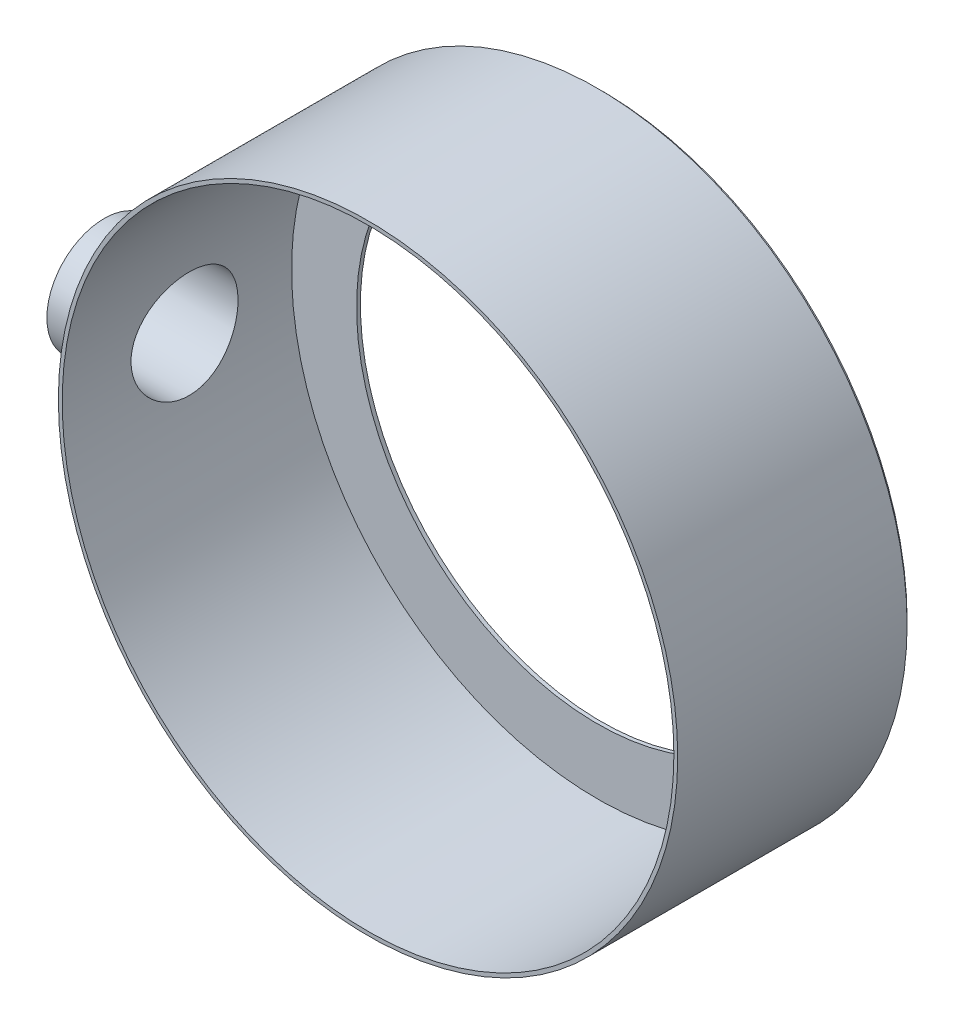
ISO-10303-21;
HEADER;
FILE_DESCRIPTION(('STEP AP214'),'2;1');
FILE_NAME('part.step','',(''),(''),'','','');
FILE_SCHEMA(('AUTOMOTIVE_DESIGN { 1 0 10303 214 1 1 1 1 }'));
ENDSEC;
DATA;
#1=APPLICATION_CONTEXT('core data for automotive mechanical design processes');
#2=APPLICATION_PROTOCOL_DEFINITION('international standard','automotive_design',2000,#1);
#3=PRODUCT_CONTEXT('',#1,'mechanical');
#4=PRODUCT('Part','Part','',(#3));
#5=PRODUCT_RELATED_PRODUCT_CATEGORY('part','',(#4));
#6=PRODUCT_DEFINITION_FORMATION('','',#4);
#7=PRODUCT_DEFINITION_CONTEXT('part definition',#1,'design');
#8=PRODUCT_DEFINITION('design','',#6,#7);
#9=PRODUCT_DEFINITION_SHAPE('','',#8);
#10=(LENGTH_UNIT() NAMED_UNIT(*) SI_UNIT(.MILLI.,.METRE.));
#11=(NAMED_UNIT(*) PLANE_ANGLE_UNIT() SI_UNIT($,.RADIAN.));
#12=(NAMED_UNIT(*) SI_UNIT($,.STERADIAN.) SOLID_ANGLE_UNIT());
#13=UNCERTAINTY_MEASURE_WITH_UNIT(LENGTH_MEASURE(1.E-05),#10,'distance_accuracy_value','');
#14=(GEOMETRIC_REPRESENTATION_CONTEXT(3) GLOBAL_UNCERTAINTY_ASSIGNED_CONTEXT((#13)) GLOBAL_UNIT_ASSIGNED_CONTEXT((#10,
#11,#12)) REPRESENTATION_CONTEXT('',''));
#15=CARTESIAN_POINT('',(0.,0.,0.));
#16=DIRECTION('',(0.,0.,1.));
#17=DIRECTION('',(1.,0.,0.));
#18=AXIS2_PLACEMENT_3D('',#15,#16,#17);
#19=CARTESIAN_POINT('',(0.,0.,30.5));
#20=DIRECTION('',(0.,0.,-1.));
#21=DIRECTION('',(-1.,0.,0.));
#22=AXIS2_PLACEMENT_3D('',#19,#20,#21);
#23=CYLINDRICAL_SURFACE('',#22,40.5);
#24=CARTESIAN_POINT('',(0.,0.,0.5));
#25=DIRECTION('',(0.,0.,1.));
#26=DIRECTION('',(1.,0.,0.));
#27=AXIS2_PLACEMENT_3D('',#24,#25,#26);
#28=CIRCLE('',#27,40.5);
#29=CARTESIAN_POINT('',(40.5,0.,0.5));
#30=VERTEX_POINT('',#29);
#31=EDGE_CURVE('E58',#30,#30,#28,.T.);
#32=ORIENTED_EDGE('',*,*,#31,.T.);
#33=EDGE_LOOP('',(#32));
#34=FACE_BOUND('',#33,.T.);
#35=CARTESIAN_POINT('',(0.,0.,30.5));
#36=DIRECTION('',(0.,0.,1.));
#37=DIRECTION('',(1.,0.,0.));
#38=AXIS2_PLACEMENT_3D('',#35,#36,#37);
#39=CIRCLE('',#38,40.5);
#40=CARTESIAN_POINT('',(40.5,0.,30.5));
#41=VERTEX_POINT('',#40);
#42=EDGE_CURVE('E54',#41,#41,#39,.T.);
#43=ORIENTED_EDGE('',*,*,#42,.F.);
#44=EDGE_LOOP('',(#43));
#45=FACE_BOUND('',#44,.T.);
#46=CARTESIAN_POINT('',(-40.5,0.,22.));
#47=CARTESIAN_POINT('',(-40.5000017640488,0.208797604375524,22.0000037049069));
#48=CARTESIAN_POINT('',(-40.4983824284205,0.41754711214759,21.991278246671));
#49=CARTESIAN_POINT('',(-40.4919541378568,0.833605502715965,21.9564512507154));
#50=CARTESIAN_POINT('',(-40.4871446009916,1.04091411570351,21.9303465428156));
#51=CARTESIAN_POINT('',(-40.4744644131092,1.45265078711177,21.8609392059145));
#52=CARTESIAN_POINT('',(-40.4665920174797,1.65707713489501,21.8176267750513));
#53=CARTESIAN_POINT('',(-40.4480033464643,2.06155932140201,21.7141227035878));
#54=CARTESIAN_POINT('',(-40.4372860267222,2.26161352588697,21.6539248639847));
#55=CARTESIAN_POINT('',(-40.4133221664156,2.6556168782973,21.5172023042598));
#56=CARTESIAN_POINT('',(-40.4000788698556,2.84957348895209,21.4406985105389));
#57=CARTESIAN_POINT('',(-40.3714143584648,3.23038388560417,21.2718548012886));
#58=CARTESIAN_POINT('',(-40.3559923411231,3.41723502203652,21.1795090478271));
#59=CARTESIAN_POINT('',(-40.3234052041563,3.78240467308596,20.9797154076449));
#60=CARTESIAN_POINT('',(-40.3062409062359,3.96072715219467,20.8722746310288));
#61=CARTESIAN_POINT('',(-40.2706254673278,4.30780387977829,20.6429718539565));
#62=CARTESIAN_POINT('',(-40.2521738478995,4.47655452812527,20.5211044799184));
#63=CARTESIAN_POINT('',(-40.2143019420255,4.80494733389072,20.262516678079));
#64=CARTESIAN_POINT('',(-40.1948737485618,4.96448016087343,20.1256585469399));
#65=CARTESIAN_POINT('',(-40.1557569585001,5.27154177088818,19.8390053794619));
#66=CARTESIAN_POINT('',(-40.136068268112,5.41906608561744,19.6892055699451));
#67=CARTESIAN_POINT('',(-40.0969932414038,5.70099870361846,19.3777780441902));
#68=CARTESIAN_POINT('',(-40.0776068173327,5.83541087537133,19.2161538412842));
#69=CARTESIAN_POINT('',(-40.0396678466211,6.09028828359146,18.882071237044));
#70=CARTESIAN_POINT('',(-40.021115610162,6.21074835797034,18.7096088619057));
#71=CARTESIAN_POINT('',(-39.9852436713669,6.43766954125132,18.3537358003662));
#72=CARTESIAN_POINT('',(-39.9679343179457,6.54401824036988,18.1702523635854));
#73=CARTESIAN_POINT('',(-39.9352070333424,6.74086046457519,17.7948031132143));
#74=CARTESIAN_POINT('',(-39.9197891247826,6.83135380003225,17.6028371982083));
#75=CARTESIAN_POINT('',(-39.8912998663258,6.99579609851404,17.2117931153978));
#76=CARTESIAN_POINT('',(-39.8782283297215,7.06974637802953,17.0127155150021));
#77=CARTESIAN_POINT('',(-39.854819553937,7.20054006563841,16.6088561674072));
#78=CARTESIAN_POINT('',(-39.844482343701,7.25738329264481,16.4040743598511));
#79=CARTESIAN_POINT('',(-39.8269533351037,7.35296704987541,15.9926400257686));
#80=CARTESIAN_POINT('',(-39.8197273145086,7.3919048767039,15.786034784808));
#81=CARTESIAN_POINT('',(-39.8084671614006,7.45230761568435,15.3702016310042));
#82=CARTESIAN_POINT('',(-39.8044329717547,7.47377284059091,15.1609737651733));
#83=CARTESIAN_POINT('',(-39.7996770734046,7.49905801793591,14.7414319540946));
#84=CARTESIAN_POINT('',(-39.7989551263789,7.50287923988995,14.5311180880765));
#85=CARTESIAN_POINT('',(-39.8008446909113,7.49284912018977,14.1109280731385));
#86=CARTESIAN_POINT('',(-39.8034561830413,7.47899788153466,13.9010519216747));
#87=CARTESIAN_POINT('',(-39.8118791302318,7.43402941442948,13.485992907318));
#88=CARTESIAN_POINT('',(-39.8176484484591,7.40313950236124,13.2807845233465));
#89=CARTESIAN_POINT('',(-39.8321923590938,7.32448282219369,12.8736679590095));
#90=CARTESIAN_POINT('',(-39.8409679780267,7.27671028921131,12.6717609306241));
#91=CARTESIAN_POINT('',(-39.8612700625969,7.16466262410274,12.2727799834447));
#92=CARTESIAN_POINT('',(-39.8727956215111,7.10039293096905,12.0757044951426));
#93=CARTESIAN_POINT('',(-39.8982667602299,6.95583723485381,11.6876559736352));
#94=CARTESIAN_POINT('',(-39.9122132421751,6.8755452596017,11.4966852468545));
#95=CARTESIAN_POINT('',(-39.9572789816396,6.61046735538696,10.9328653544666));
#96=CARTESIAN_POINT('',(-39.9915204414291,6.4020247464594,10.5710446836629));
#97=CARTESIAN_POINT('',(-40.064450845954,5.92848462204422,9.88737825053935));
#98=CARTESIAN_POINT('',(-40.1031402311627,5.66338149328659,9.56553645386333));
#99=CARTESIAN_POINT('',(-40.1813476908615,5.07910487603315,8.96550832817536));
#100=CARTESIAN_POINT('',(-40.2208693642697,4.7591631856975,8.68806874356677));
#101=CARTESIAN_POINT('',(-40.2957386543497,4.07688984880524,8.19070331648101));
#102=CARTESIAN_POINT('',(-40.3310862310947,3.71455779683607,7.97077802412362));
#103=CARTESIAN_POINT('',(-40.3936941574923,2.95701105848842,7.59455900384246));
#104=CARTESIAN_POINT('',(-40.4209447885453,2.56175757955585,7.43834166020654));
#105=CARTESIAN_POINT('',(-40.4642127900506,1.75000349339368,7.19472698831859));
#106=CARTESIAN_POINT('',(-40.4802313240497,1.33350509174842,7.10732253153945));
#107=CARTESIAN_POINT('',(-40.4990709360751,0.49751718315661,7.00485041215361));
#108=CARTESIAN_POINT('',(-40.5020789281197,0.0781573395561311,6.98875816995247));
#109=CARTESIAN_POINT('',(-40.4950742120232,-0.757262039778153,7.02662248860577));
#110=CARTESIAN_POINT('',(-40.4850621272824,-1.17332173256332,7.08057569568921));
#111=CARTESIAN_POINT('',(-40.4532589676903,-1.98708740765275,7.25614283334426));
#112=CARTESIAN_POINT('',(-40.4315579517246,-2.38490880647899,7.37723965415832));
#113=CARTESIAN_POINT('',(-40.3787985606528,-3.15461106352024,7.68311474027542));
#114=CARTESIAN_POINT('',(-40.3477395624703,-3.5264901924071,7.86789724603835));
#115=CARTESIAN_POINT('',(-40.2792491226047,-4.23809054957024,8.29811242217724));
#116=CARTESIAN_POINT('',(-40.2417531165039,-4.57742556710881,8.54417225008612));
#117=CARTESIAN_POINT('',(-40.1646953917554,-5.21047708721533,9.08934361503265));
#118=CARTESIAN_POINT('',(-40.1251334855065,-5.50418943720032,9.38845997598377));
#119=CARTESIAN_POINT('',(-40.0672875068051,-5.90603053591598,9.87249923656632));
#120=CARTESIAN_POINT('',(-40.0481287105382,-6.03426687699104,10.041021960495));
#121=CARTESIAN_POINT('',(-40.0109454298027,-6.27608030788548,10.3883682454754));
#122=CARTESIAN_POINT('',(-39.9929205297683,-6.38966278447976,10.5671879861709));
#123=CARTESIAN_POINT('',(-39.9585188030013,-6.60138601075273,10.9339686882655));
#124=CARTESIAN_POINT('',(-39.9421425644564,-6.69952125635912,11.121932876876));
#125=CARTESIAN_POINT('',(-39.911528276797,-6.87955283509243,11.5055678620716));
#126=CARTESIAN_POINT('',(-39.8972893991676,-6.96145546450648,11.7012356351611));
#127=CARTESIAN_POINT('',(-39.8714211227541,-7.10811530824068,12.0980741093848));
#128=CARTESIAN_POINT('',(-39.8597804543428,-7.17294679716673,12.2992166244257));
#129=CARTESIAN_POINT('',(-39.8393773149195,-7.28541586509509,12.7063185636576));
#130=CARTESIAN_POINT('',(-39.8306137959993,-7.33305970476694,12.9122762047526));
#131=CARTESIAN_POINT('',(-39.8162208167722,-7.4108114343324,13.3276035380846));
#132=CARTESIAN_POINT('',(-39.8105916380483,-7.44091774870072,13.5369735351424));
#133=CARTESIAN_POINT('',(-39.8026384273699,-7.48334432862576,13.9575692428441));
#134=CARTESIAN_POINT('',(-39.8003143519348,-7.49566482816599,14.1687949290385));
#135=CARTESIAN_POINT('',(-39.7990512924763,-7.50236801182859,14.5882613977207));
#136=CARTESIAN_POINT('',(-39.8000603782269,-7.49702587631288,14.7964976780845));
#137=CARTESIAN_POINT('',(-39.8053200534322,-7.46904930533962,15.2117650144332));
#138=CARTESIAN_POINT('',(-39.8095706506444,-7.44641482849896,15.4187960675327));
#139=CARTESIAN_POINT('',(-39.8211888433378,-7.38403163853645,15.8301720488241));
#140=CARTESIAN_POINT('',(-39.8285564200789,-7.34428302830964,16.0345169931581));
#141=CARTESIAN_POINT('',(-39.8461938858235,-7.24798080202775,16.4390742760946));
#142=CARTESIAN_POINT('',(-39.856463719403,-7.19142750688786,16.639286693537));
#143=CARTESIAN_POINT('',(-39.879588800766,-7.06206078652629,17.0338355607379));
#144=CARTESIAN_POINT('',(-39.8924394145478,-6.98927647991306,17.2281818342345));
#145=CARTESIAN_POINT('',(-39.9203717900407,-6.8279290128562,17.6100398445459));
#146=CARTESIAN_POINT('',(-39.9354535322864,-6.73936599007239,17.7975516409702));
#147=CARTESIAN_POINT('',(-39.9674280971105,-6.54707474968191,18.1645236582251));
#148=CARTESIAN_POINT('',(-39.9843213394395,-6.44334301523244,18.3439819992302));
#149=CARTESIAN_POINT('',(-40.0194403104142,-6.22149499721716,18.6935473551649));
#150=CARTESIAN_POINT('',(-40.0376655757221,-6.10338370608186,18.8636575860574));
#151=CARTESIAN_POINT('',(-40.0752325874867,-5.85168012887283,19.1959482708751));
#152=CARTESIAN_POINT('',(-40.0945869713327,-5.71788239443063,19.3579717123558));
#153=CARTESIAN_POINT('',(-40.1336076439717,-5.43724148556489,19.6701493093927));
#154=CARTESIAN_POINT('',(-40.1532738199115,-5.29040294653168,19.8203076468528));
#155=CARTESIAN_POINT('',(-40.1923882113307,-4.98454682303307,20.1078855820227));
#156=CARTESIAN_POINT('',(-40.2118362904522,-4.82552205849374,20.2452975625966));
#157=CARTESIAN_POINT('',(-40.2499543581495,-4.49650806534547,20.5062876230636));
#158=CARTESIAN_POINT('',(-40.2686246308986,-4.32652290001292,20.629870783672));
#159=CARTESIAN_POINT('',(-40.3048407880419,-3.97508374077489,20.8634606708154));
#160=CARTESIAN_POINT('',(-40.3223748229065,-3.79353904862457,20.9733328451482));
#161=CARTESIAN_POINT('',(-40.3556260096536,-3.4217351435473,21.1773256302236));
#162=CARTESIAN_POINT('',(-40.3713438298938,-3.23147917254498,21.2714520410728));
#163=CARTESIAN_POINT('',(-40.4005129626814,-2.84364638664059,21.4432426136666));
#164=CARTESIAN_POINT('',(-40.4139657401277,-2.64607440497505,21.5209174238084));
#165=CARTESIAN_POINT('',(-40.4382303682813,-2.24497706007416,21.6592664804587));
#166=CARTESIAN_POINT('',(-40.4490427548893,-2.04145291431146,21.719944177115));
#167=CARTESIAN_POINT('',(-40.4719629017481,-1.53618591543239,21.8474772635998));
#168=CARTESIAN_POINT('',(-40.4824248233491,-1.23185556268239,21.90460007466));
#169=CARTESIAN_POINT('',(-40.4964419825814,-0.618314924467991,21.9808582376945));
#170=CARTESIAN_POINT('',(-40.4999973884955,-0.309104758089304,21.9999945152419));
#171=CARTESIAN_POINT('',(-40.5,0.,22.));
#172=B_SPLINE_CURVE_WITH_KNOTS('',3,(#46,#47,#48,#49,#50,#51,#52,#53,#54,#55,#56,#57,#58,#59,
#60,#61,#62,#63,#64,#65,#66,#67,#68,#69,#70,#71,#72,#73,#74,#75,#76,#77,#78,#79,#80,#81,#82,#83,
#84,#85,#86,#87,#88,#89,#90,#91,#92,#93,#94,#95,#96,#97,#98,#99,#100,#101,#102,#103,#104,#105,
#106,#107,#108,#109,#110,#111,#112,#113,#114,#115,#116,#117,#118,#119,#120,#121,#122,#123,#124,
#125,#126,#127,#128,#129,#130,#131,#132,#133,#134,#135,#136,#137,#138,#139,#140,#141,#142,#143,
#144,#145,#146,#147,#148,#149,#150,#151,#152,#153,#154,#155,#156,#157,#158,#159,#160,#161,#162,
#163,#164,#165,#166,#167,#168,#169,#170,#171),.UNSPECIFIED.,.T.,.F.,(4,2,2,2,2,2,2,2,2,2,2,2,2,
2,2,2,2,2,2,2,2,2,2,2,2,2,2,2,2,2,2,2,2,2,2,2,2,2,2,2,2,2,2,2,2,2,2,2,2,2,2,2,2,2,2,2,2,2,2,2,2,
2,4),(0.,0.626121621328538,1.25235748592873,1.87895057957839,2.50577401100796,3.13179779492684,
3.75805277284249,4.38401375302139,5.01020862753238,5.64273409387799,6.2754938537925,
6.90806636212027,7.54087217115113,8.17844970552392,8.81603486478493,9.45356926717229,
10.0911104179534,10.7214475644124,11.3517734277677,11.9820539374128,12.6123307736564,
13.2343955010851,13.8566728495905,14.478745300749,15.1010500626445,16.35162760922,
17.6023291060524,18.8722475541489,20.1421781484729,21.4136269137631,22.6849439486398,
23.9379348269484,25.190865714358,26.4342784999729,27.6777740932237,28.9345609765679,
30.1914621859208,30.8287276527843,31.4657581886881,32.1030151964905,32.7400245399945,
33.3742147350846,34.0081736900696,34.6421895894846,35.276197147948,35.9003738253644,
36.5245519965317,37.1487264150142,37.772888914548,38.3959405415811,39.0189867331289,
39.6421776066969,40.2651527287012,40.8974624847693,41.5295483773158,42.1620095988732,
42.7942376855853,43.4322499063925,44.0700265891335,44.7073891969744,45.3446223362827,
46.2715577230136,47.1984705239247),.UNSPECIFIED.);
#173=CARTESIAN_POINT('',(-40.5,0.,22.));
#174=VERTEX_POINT('',#173);
#175=EDGE_CURVE('E11',#174,#174,#172,.T.);
#176=ORIENTED_EDGE('',*,*,#175,.F.);
#177=EDGE_LOOP('',(#176));
#178=FACE_BOUND('',#177,.T.);
#179=ADVANCED_FACE('F43',(#34,#45,#178),#23,.T.);
#180=CARTESIAN_POINT('',(0.,0.,30.5));
#181=DIRECTION('',(0.,0.,1.));
#182=DIRECTION('',(1.,0.,0.));
#183=AXIS2_PLACEMENT_3D('',#180,#181,#182);
#184=PLANE('',#183);
#185=ORIENTED_EDGE('',*,*,#42,.T.);
#186=EDGE_LOOP('',(#185));
#187=FACE_BOUND('',#186,.T.);
#188=CARTESIAN_POINT('',(0.,0.,30.5));
#189=DIRECTION('',(0.,0.,1.));
#190=DIRECTION('',(1.,0.,0.));
#191=AXIS2_PLACEMENT_3D('',#188,#189,#190);
#192=CIRCLE('',#191,40.);
#193=CARTESIAN_POINT('',(40.,0.,30.5));
#194=VERTEX_POINT('',#193);
#195=EDGE_CURVE('E63',#194,#194,#192,.T.);
#196=ORIENTED_EDGE('',*,*,#195,.F.);
#197=EDGE_LOOP('',(#196));
#198=FACE_BOUND('',#197,.T.);
#199=ADVANCED_FACE('F96',(#187,#198),#184,.T.);
#200=CARTESIAN_POINT('',(0.,0.,0.5));
#201=DIRECTION('',(0.,0.,1.));
#202=DIRECTION('',(1.,0.,0.));
#203=AXIS2_PLACEMENT_3D('',#200,#201,#202);
#204=PLANE('',#203);
#205=ORIENTED_EDGE('',*,*,#31,.F.);
#206=EDGE_LOOP('',(#205));
#207=FACE_BOUND('',#206,.T.);
#208=CARTESIAN_POINT('',(0.,0.,0.5));
#209=DIRECTION('',(0.,0.,1.));
#210=DIRECTION('',(1.,0.,0.));
#211=AXIS2_PLACEMENT_3D('',#208,#209,#210);
#212=CIRCLE('',#211,40.);
#213=CARTESIAN_POINT('',(40.,0.,0.5));
#214=VERTEX_POINT('',#213);
#215=EDGE_CURVE('E66',#214,#214,#212,.T.);
#216=ORIENTED_EDGE('',*,*,#215,.T.);
#217=EDGE_LOOP('',(#216));
#218=FACE_BOUND('',#217,.T.);
#219=ADVANCED_FACE('F101',(#207,#218),#204,.F.);
#220=CARTESIAN_POINT('',(0.,0.,30.5));
#221=DIRECTION('',(0.,0.,-1.));
#222=DIRECTION('',(-1.,0.,0.));
#223=AXIS2_PLACEMENT_3D('',#220,#221,#222);
#224=CYLINDRICAL_SURFACE('',#223,40.);
#225=CARTESIAN_POINT('',(-40.,0.,21.5));
#226=CARTESIAN_POINT('',(-40.0000014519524,-0.195066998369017,21.5000032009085));
#227=CARTESIAN_POINT('',(-39.9985704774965,-0.39009145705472,21.4918437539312));
#228=CARTESIAN_POINT('',(-39.992889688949,-0.778797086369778,21.4592744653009));
#229=CARTESIAN_POINT('',(-39.9886393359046,-0.97247799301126,21.4348615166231));
#230=CARTESIAN_POINT('',(-39.9774334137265,-1.35715911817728,21.3699489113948));
#231=CARTESIAN_POINT('',(-39.9704762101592,-1.54815764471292,21.3294395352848));
#232=CARTESIAN_POINT('',(-39.9540488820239,-1.9260744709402,21.2326293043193));
#233=CARTESIAN_POINT('',(-39.9445778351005,-2.11299124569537,21.1763226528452));
#234=CARTESIAN_POINT('',(-39.9234010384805,-2.48113007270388,21.0484287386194));
#235=CARTESIAN_POINT('',(-39.9116980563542,-2.66235885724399,20.9768603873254));
#236=CARTESIAN_POINT('',(-39.8863690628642,-3.01817668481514,20.8189012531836));
#237=CARTESIAN_POINT('',(-39.8727423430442,-3.19276325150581,20.7325050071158));
#238=CARTESIAN_POINT('',(-39.8439516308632,-3.53395228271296,20.5455770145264));
#239=CARTESIAN_POINT('',(-39.8287883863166,-3.70055857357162,20.4450521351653));
#240=CARTESIAN_POINT('',(-39.7973291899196,-4.02481518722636,20.2305035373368));
#241=CARTESIAN_POINT('',(-39.7810328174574,-4.18246214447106,20.1164747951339));
#242=CARTESIAN_POINT('',(-39.7476082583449,-4.48905736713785,19.8746467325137));
#243=CARTESIAN_POINT('',(-39.7304738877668,-4.63791419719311,19.7467323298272));
#244=CARTESIAN_POINT('',(-39.6959828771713,-4.92440590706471,19.4788255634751));
#245=CARTESIAN_POINT('',(-39.6786261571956,-5.06203661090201,19.3388287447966));
#246=CARTESIAN_POINT('',(-39.6441875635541,-5.32503340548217,19.0477987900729));
#247=CARTESIAN_POINT('',(-39.6271056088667,-5.45040316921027,18.896768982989));
#248=CARTESIAN_POINT('',(-39.5936854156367,-5.68810074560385,18.5846065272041));
#249=CARTESIAN_POINT('',(-39.5773474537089,-5.80042373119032,18.423470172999));
#250=CARTESIAN_POINT('',(-39.5457803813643,-6.0118851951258,18.0911395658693));
#251=CARTESIAN_POINT('',(-39.5305593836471,-6.110930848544,17.9198854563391));
#252=CARTESIAN_POINT('',(-39.5017889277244,-6.29422615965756,17.5694966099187));
#253=CARTESIAN_POINT('',(-39.4882394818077,-6.37847570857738,17.3903618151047));
#254=CARTESIAN_POINT('',(-39.4632104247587,-6.53154202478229,17.0254891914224));
#255=CARTESIAN_POINT('',(-39.4517306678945,-6.60035987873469,16.8397518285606));
#256=CARTESIAN_POINT('',(-39.4311798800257,-6.72204318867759,16.462988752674));
#257=CARTESIAN_POINT('',(-39.4221088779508,-6.77490845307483,16.2719629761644));
#258=CARTESIAN_POINT('',(-39.4067270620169,-6.86380939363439,15.8880021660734));
#259=CARTESIAN_POINT('',(-39.4003887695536,-6.90001287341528,15.6951070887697));
#260=CARTESIAN_POINT('',(-39.3905226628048,-6.95611485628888,15.3068230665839));
#261=CARTESIAN_POINT('',(-39.3869958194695,-6.97600772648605,15.1114332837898));
#262=CARTESIAN_POINT('',(-39.3828639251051,-6.99929891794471,14.7197130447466));
#263=CARTESIAN_POINT('',(-39.3822576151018,-7.00270434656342,14.5233830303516));
#264=CARTESIAN_POINT('',(-39.3839747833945,-6.99303192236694,14.1311226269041));
#265=CARTESIAN_POINT('',(-39.3862993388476,-6.97994800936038,13.9351924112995));
#266=CARTESIAN_POINT('',(-39.3975114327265,-6.91652753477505,13.3547578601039));
#267=CARTESIAN_POINT('',(-39.4105881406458,-6.84230729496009,12.9726538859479));
#268=CARTESIAN_POINT('',(-39.4465327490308,-6.63190827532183,12.2266205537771));
#269=CARTESIAN_POINT('',(-39.4694010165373,-6.49572717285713,11.8626918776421));
#270=CARTESIAN_POINT('',(-39.5224845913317,-6.16452589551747,11.1608547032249));
#271=CARTESIAN_POINT('',(-39.5527379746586,-5.969199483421,10.8230934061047));
#272=CARTESIAN_POINT('',(-39.617158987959,-5.52546949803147,10.1848739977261));
#273=CARTESIAN_POINT('',(-39.6513269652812,-5.27706121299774,9.88441920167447));
#274=CARTESIAN_POINT('',(-39.7203005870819,-4.73017361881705,9.32500989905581));
#275=CARTESIAN_POINT('',(-39.7551085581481,-4.43105547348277,9.06667974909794));
#276=CARTESIAN_POINT('',(-39.8210089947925,-3.79339072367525,8.60377989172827));
#277=CARTESIAN_POINT('',(-39.8521014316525,-3.45484381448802,8.39921059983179));
#278=CARTESIAN_POINT('',(-39.9071185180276,-2.74731974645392,8.04956765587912));
#279=CARTESIAN_POINT('',(-39.9310360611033,-2.37831287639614,7.90455293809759));
#280=CARTESIAN_POINT('',(-39.9689523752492,-1.62066798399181,7.67873539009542));
#281=CARTESIAN_POINT('',(-39.9829520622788,-1.23203177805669,7.59792663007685));
#282=CARTESIAN_POINT('',(-39.9993310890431,-0.451538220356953,7.50366993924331));
#283=CARTESIAN_POINT('',(-40.0018581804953,-0.0597873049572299,7.48936546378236));
#284=CARTESIAN_POINT('',(-39.9954132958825,0.720511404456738,7.5262345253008));
#285=CARTESIAN_POINT('',(-39.9864418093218,1.10905933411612,7.57740527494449));
#286=CARTESIAN_POINT('',(-39.9580994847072,1.86924931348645,7.74305949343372));
#287=CARTESIAN_POINT('',(-39.9387989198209,2.24098740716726,7.8571152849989));
#288=CARTESIAN_POINT('',(-39.891953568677,2.96006605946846,8.14484475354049));
#289=CARTESIAN_POINT('',(-39.8644082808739,3.30740513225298,8.31852205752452));
#290=CARTESIAN_POINT('',(-39.8037613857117,3.97152026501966,8.72249557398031));
#291=CARTESIAN_POINT('',(-39.7706086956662,4.28796882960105,8.95332229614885));
#292=CARTESIAN_POINT('',(-39.702568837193,4.87794917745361,9.46433641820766));
#293=CARTESIAN_POINT('',(-39.6676815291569,5.15147749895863,9.7445277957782));
#294=CARTESIAN_POINT('',(-39.5996233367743,5.65104030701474,10.3501012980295));
#295=CARTESIAN_POINT('',(-39.5664767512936,5.87649359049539,10.6759652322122));
#296=CARTESIAN_POINT('',(-39.5061141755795,6.26950839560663,11.3616619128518));
#297=CARTESIAN_POINT('',(-39.4788979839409,6.43707188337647,11.72149350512));
#298=CARTESIAN_POINT('',(-39.4449500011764,6.64082086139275,12.2777323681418));
#299=CARTESIAN_POINT('',(-39.4347914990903,6.70074291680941,12.4655613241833));
#300=CARTESIAN_POINT('',(-39.4170113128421,6.80455949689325,12.8456981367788));
#301=CARTESIAN_POINT('',(-39.4093887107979,6.84845982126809,13.0380043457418));
#302=CARTESIAN_POINT('',(-39.3969094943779,6.91988660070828,13.4257313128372));
#303=CARTESIAN_POINT('',(-39.3920531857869,6.94741124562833,13.6211524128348));
#304=CARTESIAN_POINT('',(-39.3852513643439,6.98586862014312,14.0136691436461));
#305=CARTESIAN_POINT('',(-39.3833057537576,6.99680190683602,14.2107647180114));
#306=CARTESIAN_POINT('',(-39.3823903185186,7.00195240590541,14.6024600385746));
#307=CARTESIAN_POINT('',(-39.3833798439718,6.99639796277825,14.7970567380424));
#308=CARTESIAN_POINT('',(-39.3882177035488,6.96911025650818,15.1850736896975));
#309=CARTESIAN_POINT('',(-39.39206598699,6.94737728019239,15.3784939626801));
#310=CARTESIAN_POINT('',(-39.4025099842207,6.88789638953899,15.7628146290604));
#311=CARTESIAN_POINT('',(-39.4091061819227,6.85014565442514,15.953714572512));
#312=CARTESIAN_POINT('',(-39.4248516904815,6.75893536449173,16.3315424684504));
#313=CARTESIAN_POINT('',(-39.4340000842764,6.70548145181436,16.5184718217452));
#314=CARTESIAN_POINT('',(-39.4545766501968,6.58332815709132,16.8869270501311));
#315=CARTESIAN_POINT('',(-39.4660023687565,6.51464517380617,17.068458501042));
#316=CARTESIAN_POINT('',(-39.4908103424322,6.36253334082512,17.4250170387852));
#317=CARTESIAN_POINT('',(-39.5041918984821,6.27910975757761,17.6000464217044));
#318=CARTESIAN_POINT('',(-39.5325439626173,6.09806215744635,17.9425536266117));
#319=CARTESIAN_POINT('',(-39.5475151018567,6.0004324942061,18.1100284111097));
#320=CARTESIAN_POINT('',(-39.5786194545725,5.79171871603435,18.4361739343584));
#321=CARTESIAN_POINT('',(-39.5947522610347,5.68063930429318,18.594847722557));
#322=CARTESIAN_POINT('',(-39.6279617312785,5.44417935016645,18.9044708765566));
#323=CARTESIAN_POINT('',(-39.6450481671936,5.31862664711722,19.0552877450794));
#324=CARTESIAN_POINT('',(-39.6794761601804,5.05537162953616,19.3457845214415));
#325=CARTESIAN_POINT('',(-39.6968176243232,4.91767365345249,19.4854683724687));
#326=CARTESIAN_POINT('',(-39.7312875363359,4.63094460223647,19.7528854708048));
#327=CARTESIAN_POINT('',(-39.748415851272,4.48190683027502,19.880611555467));
#328=CARTESIAN_POINT('',(-39.7819649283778,4.17364243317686,20.1230908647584));
#329=CARTESIAN_POINT('',(-39.7983859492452,4.01441958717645,20.2378488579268));
#330=CARTESIAN_POINT('',(-39.8301978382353,3.68549246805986,20.454514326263));
#331=CARTESIAN_POINT('',(-39.8455792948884,3.51571380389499,20.5563102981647));
#332=CARTESIAN_POINT('',(-39.8747229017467,3.16810379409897,20.745176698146));
#333=CARTESIAN_POINT('',(-39.8884856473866,2.99027544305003,20.8322525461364));
#334=CARTESIAN_POINT('',(-39.9139978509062,2.62787618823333,20.9910220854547));
#335=CARTESIAN_POINT('',(-39.9257486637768,2.44330992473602,21.0627261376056));
#336=CARTESIAN_POINT('',(-39.9469106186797,2.06870726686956,21.1902622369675));
#337=CARTESIAN_POINT('',(-39.9563222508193,1.87867202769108,21.2460976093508));
#338=CARTESIAN_POINT('',(-39.9760463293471,1.41120455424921,21.3621357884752));
#339=CARTESIAN_POINT('',(-39.9849859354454,1.13154100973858,21.4137713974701));
#340=CARTESIAN_POINT('',(-39.996961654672,0.567888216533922,21.4827008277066));
#341=CARTESIAN_POINT('',(-39.9999978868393,0.283899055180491,21.4999953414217));
#342=CARTESIAN_POINT('',(-40.,0.,21.5));
#343=B_SPLINE_CURVE_WITH_KNOTS('',3,(#225,#226,#227,#228,#229,#230,#231,#232,#233,#234,#235,
#236,#237,#238,#239,#240,#241,#242,#243,#244,#245,#246,#247,#248,#249,#250,#251,#252,#253,#254,
#255,#256,#257,#258,#259,#260,#261,#262,#263,#264,#265,#266,#267,#268,#269,#270,#271,#272,#273,
#274,#275,#276,#277,#278,#279,#280,#281,#282,#283,#284,#285,#286,#287,#288,#289,#290,#291,#292,
#293,#294,#295,#296,#297,#298,#299,#300,#301,#302,#303,#304,#305,#306,#307,#308,#309,#310,#311,
#312,#313,#314,#315,#316,#317,#318,#319,#320,#321,#322,#323,#324,#325,#326,#327,#328,#329,#330,
#331,#332,#333,#334,#335,#336,#337,#338,#339,#340,#341,#342),.UNSPECIFIED.,.T.,.F.,(4,2,2,2,2,2,
2,2,2,2,2,2,2,2,2,2,2,2,2,2,2,2,2,2,2,2,2,2,2,2,2,2,2,2,2,2,2,2,2,2,2,2,2,2,2,2,2,2,2,2,2,2,2,2,
2,2,2,2,4),(0.,0.58495204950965,1.17001595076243,1.75543367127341,2.34106648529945,
2.92597778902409,3.51110506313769,4.09594891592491,4.68101103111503,5.27135785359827,
5.86192328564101,6.45231125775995,7.04291697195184,7.6374574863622,8.23200237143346,
8.82650537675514,9.42101552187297,10.009399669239,10.5979869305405,11.186320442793,
11.7748702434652,12.9372681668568,14.0997096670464,15.2682759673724,16.4369460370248,
17.6216130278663,18.8062891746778,19.9921348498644,21.1778709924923,22.3482922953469,
23.5186637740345,24.6811720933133,25.8437511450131,27.0175558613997,28.1914552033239,
29.3788292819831,30.5661630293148,31.1578255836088,31.7492737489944,32.3407872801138,
32.9322809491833,33.5156212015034,34.0989511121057,34.6823837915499,35.2656070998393,
35.8482054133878,36.4305959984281,37.0132186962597,37.5956382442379,38.1858864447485,
38.7759246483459,39.3663140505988,39.9564856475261,40.5514330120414,41.1461608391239,
41.7404865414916,42.3346876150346,43.1860396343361,44.037374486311),.UNSPECIFIED.);
#344=CARTESIAN_POINT('',(-40.,0.,21.5));
#345=VERTEX_POINT('',#344);
#346=EDGE_CURVE('E68',#345,#345,#343,.T.);
#347=ORIENTED_EDGE('',*,*,#346,.F.);
#348=EDGE_LOOP('',(#347));
#349=FACE_BOUND('',#348,.T.);
#350=ORIENTED_EDGE('',*,*,#195,.T.);
#351=EDGE_LOOP('',(#350));
#352=FACE_BOUND('',#351,.T.);
#353=ORIENTED_EDGE('',*,*,#215,.F.);
#354=EDGE_LOOP('',(#353));
#355=FACE_BOUND('',#354,.T.);
#356=ADVANCED_FACE('F76',(#349,#352,#355),#224,.F.);
#357=CARTESIAN_POINT('',(-40.5,0.,14.5));
#358=DIRECTION('',(1.,0.,0.));
#359=DIRECTION('',(0.,0.,-1.));
#360=AXIS2_PLACEMENT_3D('',#357,#358,#359);
#361=CYLINDRICAL_SURFACE('',#360,7.);
#362=ORIENTED_EDGE('',*,*,#346,.T.);
#363=EDGE_LOOP('',(#362));
#364=FACE_BOUND('',#363,.T.);
#365=CARTESIAN_POINT('',(-50.5,0.,14.5));
#366=DIRECTION('',(-1.,0.,0.));
#367=DIRECTION('',(0.,0.,1.));
#368=AXIS2_PLACEMENT_3D('',#365,#366,#367);
#369=CIRCLE('',#368,7.);
#370=CARTESIAN_POINT('',(-50.5,0.,21.5));
#371=VERTEX_POINT('',#370);
#372=EDGE_CURVE('E117',#371,#371,#369,.T.);
#373=ORIENTED_EDGE('',*,*,#372,.T.);
#374=EDGE_LOOP('',(#373));
#375=FACE_BOUND('',#374,.T.);
#376=ADVANCED_FACE('F79',(#364,#375),#361,.F.);
#377=CARTESIAN_POINT('',(-50.5,0.,14.5));
#378=DIRECTION('',(1.,0.,0.));
#379=DIRECTION('',(0.,0.,-1.));
#380=AXIS2_PLACEMENT_3D('',#377,#378,#379);
#381=CYLINDRICAL_SURFACE('',#380,7.5);
#382=CARTESIAN_POINT('',(-50.5,0.,14.5));
#383=DIRECTION('',(-1.,0.,0.));
#384=DIRECTION('',(0.,0.,1.));
#385=AXIS2_PLACEMENT_3D('',#382,#383,#384);
#386=CIRCLE('',#385,7.5);
#387=CARTESIAN_POINT('',(-50.5,0.,22.));
#388=VERTEX_POINT('',#387);
#389=EDGE_CURVE('E75',#388,#388,#386,.T.);
#390=ORIENTED_EDGE('',*,*,#389,.F.);
#391=EDGE_LOOP('',(#390));
#392=FACE_BOUND('',#391,.T.);
#393=ORIENTED_EDGE('',*,*,#175,.T.);
#394=EDGE_LOOP('',(#393));
#395=FACE_BOUND('',#394,.T.);
#396=ADVANCED_FACE('F82',(#392,#395),#381,.T.);
#397=CARTESIAN_POINT('',(-50.5,0.,0.));
#398=DIRECTION('',(-1.,0.,0.));
#399=DIRECTION('',(0.,0.,1.));
#400=AXIS2_PLACEMENT_3D('',#397,#398,#399);
#401=PLANE('',#400);
#402=ORIENTED_EDGE('',*,*,#372,.F.);
#403=EDGE_LOOP('',(#402));
#404=FACE_BOUND('',#403,.T.);
#405=ORIENTED_EDGE('',*,*,#389,.T.);
#406=EDGE_LOOP('',(#405));
#407=FACE_BOUND('',#406,.T.);
#408=ADVANCED_FACE('F87',(#404,#407),#401,.T.);
#409=CLOSED_SHELL('',(#179,#199,#219,#356,#376,#396,#408));
#410=MANIFOLD_SOLID_BREP('B2',#409);
#411=CARTESIAN_POINT('',(0.,0.,0.5));
#412=DIRECTION('',(0.,0.,1.));
#413=DIRECTION('',(1.,0.,0.));
#414=AXIS2_PLACEMENT_3D('',#411,#412,#413);
#415=PLANE('',#414);
#416=CARTESIAN_POINT('',(0.,0.,0.5));
#417=DIRECTION('',(0.,0.,1.));
#418=DIRECTION('',(1.,0.,0.));
#419=AXIS2_PLACEMENT_3D('',#416,#417,#418);
#420=CIRCLE('',#419,40.);
#421=CARTESIAN_POINT('',(40.,0.,0.5));
#422=VERTEX_POINT('',#421);
#423=EDGE_CURVE('E42',#422,#422,#420,.T.);
#424=ORIENTED_EDGE('',*,*,#423,.T.);
#425=EDGE_LOOP('',(#424));
#426=FACE_BOUND('',#425,.T.);
#427=CARTESIAN_POINT('',(0.,0.,0.5));
#428=DIRECTION('',(0.,0.,1.));
#429=DIRECTION('',(1.,0.,0.));
#430=AXIS2_PLACEMENT_3D('',#427,#428,#429);
#431=CIRCLE('',#430,31.5);
#432=CARTESIAN_POINT('',(31.5,0.,0.5));
#433=VERTEX_POINT('',#432);
#434=EDGE_CURVE('E179',#433,#433,#431,.T.);
#435=ORIENTED_EDGE('',*,*,#434,.F.);
#436=EDGE_LOOP('',(#435));
#437=FACE_BOUND('',#436,.T.);
#438=ADVANCED_FACE('F168',(#426,#437),#415,.T.);
#439=CARTESIAN_POINT('',(0.,0.,0.));
#440=DIRECTION('',(0.,0.,1.));
#441=DIRECTION('',(1.,0.,0.));
#442=AXIS2_PLACEMENT_3D('',#439,#440,#441);
#443=PLANE('',#442);
#444=CARTESIAN_POINT('',(0.,0.,0.));
#445=DIRECTION('',(0.,0.,1.));
#446=DIRECTION('',(1.,0.,0.));
#447=AXIS2_PLACEMENT_3D('',#444,#445,#446);
#448=CIRCLE('',#447,40.);
#449=CARTESIAN_POINT('',(40.,0.,0.));
#450=VERTEX_POINT('',#449);
#451=EDGE_CURVE('E172',#450,#450,#448,.T.);
#452=ORIENTED_EDGE('',*,*,#451,.F.);
#453=EDGE_LOOP('',(#452));
#454=FACE_BOUND('',#453,.T.);
#455=CARTESIAN_POINT('',(0.,0.,0.));
#456=DIRECTION('',(0.,0.,1.));
#457=DIRECTION('',(1.,0.,0.));
#458=AXIS2_PLACEMENT_3D('',#455,#456,#457);
#459=CIRCLE('',#458,31.5);
#460=CARTESIAN_POINT('',(31.5,0.,0.));
#461=VERTEX_POINT('',#460);
#462=EDGE_CURVE('E181',#461,#461,#459,.T.);
#463=ORIENTED_EDGE('',*,*,#462,.T.);
#464=EDGE_LOOP('',(#463));
#465=FACE_BOUND('',#464,.T.);
#466=ADVANCED_FACE('F191',(#454,#465),#443,.F.);
#467=CARTESIAN_POINT('',(0.,0.,0.5));
#468=DIRECTION('',(0.,0.,-1.));
#469=DIRECTION('',(-1.,0.,0.));
#470=AXIS2_PLACEMENT_3D('',#467,#468,#469);
#471=CYLINDRICAL_SURFACE('',#470,40.);
#472=ORIENTED_EDGE('',*,*,#423,.F.);
#473=EDGE_LOOP('',(#472));
#474=FACE_BOUND('',#473,.T.);
#475=ORIENTED_EDGE('',*,*,#451,.T.);
#476=EDGE_LOOP('',(#475));
#477=FACE_BOUND('',#476,.T.);
#478=ADVANCED_FACE('F170',(#474,#477),#471,.T.);
#479=CARTESIAN_POINT('',(0.,0.,0.5));
#480=DIRECTION('',(0.,0.,-1.));
#481=DIRECTION('',(-1.,0.,0.));
#482=AXIS2_PLACEMENT_3D('',#479,#480,#481);
#483=CYLINDRICAL_SURFACE('',#482,31.5);
#484=ORIENTED_EDGE('',*,*,#434,.T.);
#485=EDGE_LOOP('',(#484));
#486=FACE_BOUND('',#485,.T.);
#487=ORIENTED_EDGE('',*,*,#462,.F.);
#488=EDGE_LOOP('',(#487));
#489=FACE_BOUND('',#488,.T.);
#490=ADVANCED_FACE('F187',(#486,#489),#483,.F.);
#491=CLOSED_SHELL('',(#438,#466,#478,#490));
#492=MANIFOLD_SOLID_BREP('B6',#491);
#493=ADVANCED_BREP_SHAPE_REPRESENTATION('',(#18,#410,#492),#14);
#494=SHAPE_DEFINITION_REPRESENTATION(#9,#493);
ENDSEC;
END-ISO-10303-21;
